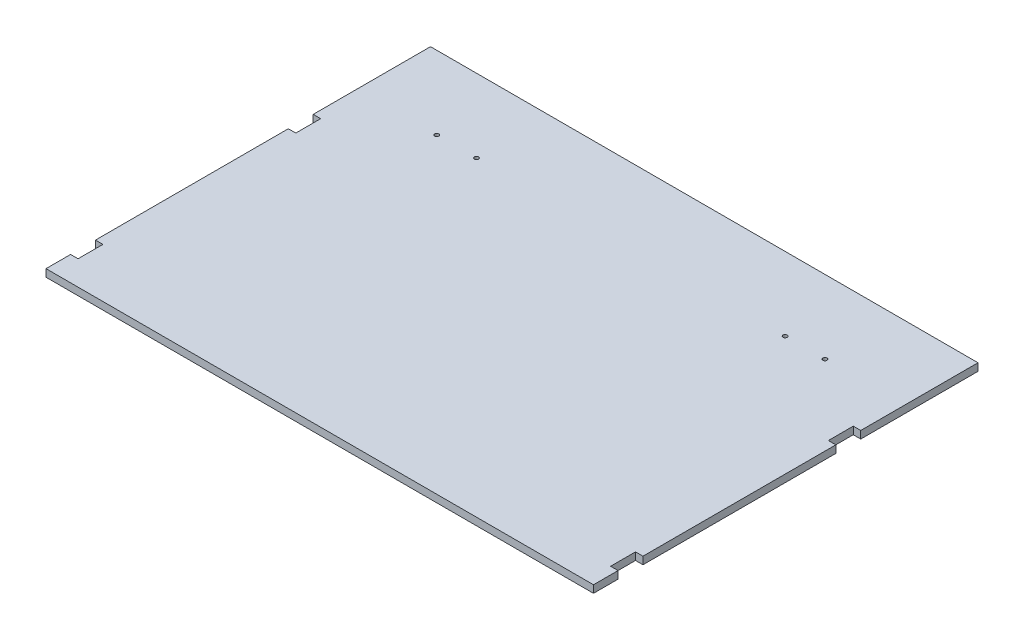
from build123d import *

# Parameters (mm, degrees)
SKIZZE1_R                       = 1.65
AUFSATZ_LINEAR_AUSTRAGEN1_DEPTH = 6


with BuildPart() as part:
    # Skizze1 → Aufsatz-Linear austragen1 (new body)
    with BuildSketch(Plane(origin=(0, 0, 0), x_dir=(1, 0, 0), z_dir=(0, 1, 0))):
        Polygon((220, 40.25), (220, -114.75), (214, -114.75), (214, -134.75), (220, -134.75), (220, -154.5), (-220, -154.5), (-220, -134.75), (-214, -134.75), (-214, -114.75), (-220, -114.75), (-220, 40.25), (-214, 40.25), (-214, 60.25), (-220, 60.25), (-220, 154.5), (220, 154.5), (220, 60.25), (214, 60.25), (214, 40.25), align=None)
        with Locations(Location((-156, 95.5, 0), (0, 0, 270))):
            Circle(SKIZZE1_R, mode=Mode.SUBTRACT)
        with Locations(Location((-124, 95.5, 0), (0, 0, 90))):
            Circle(SKIZZE1_R, mode=Mode.SUBTRACT)
        with Locations(Location((156, 95.5, 0), (0, 0, 90))):
            Circle(SKIZZE1_R, mode=Mode.SUBTRACT)
        with Locations(Location((124, 95.5, 0), (0, 0, 270))):
            Circle(SKIZZE1_R, mode=Mode.SUBTRACT)
    extrude(amount=AUFSATZ_LINEAR_AUSTRAGEN1_DEPTH)


solid = part.part
